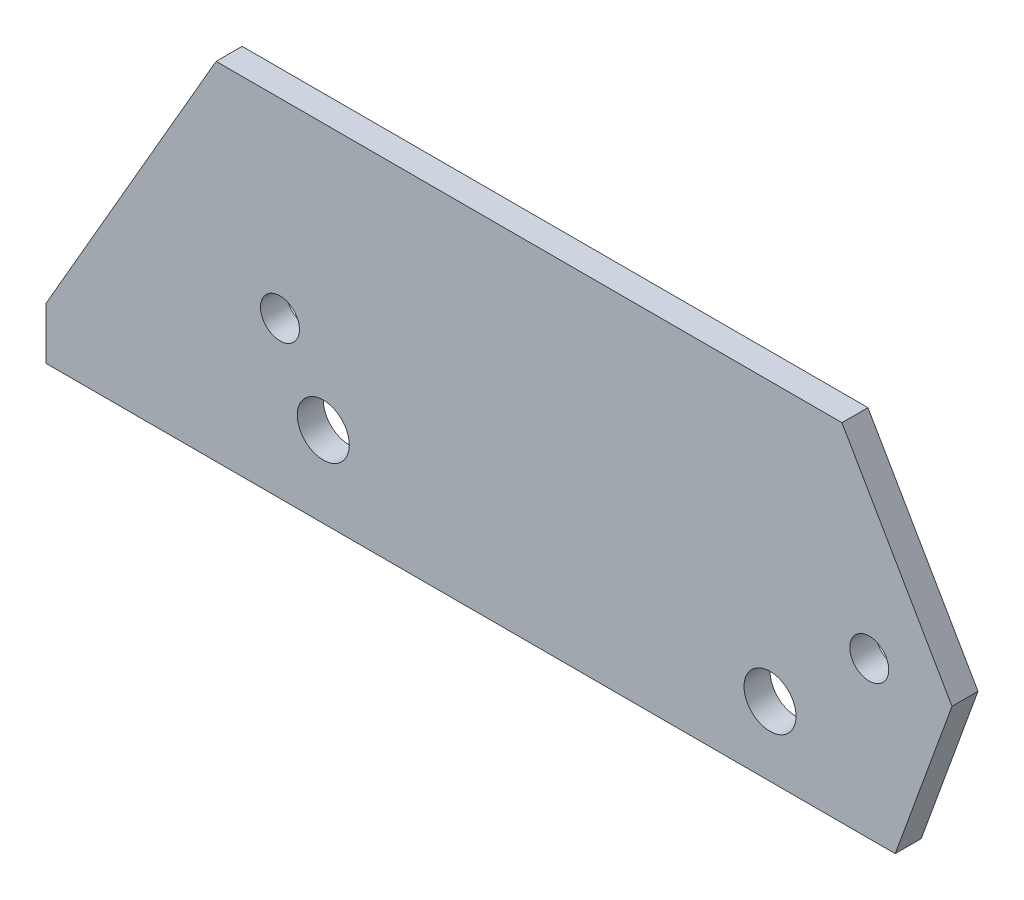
from build123d import *

# Parameters (mm, degrees)
SKETCH1_R      = 2.25
SKETCH1_R_2    = 3
EXTRUDE1_DEPTH = 3


with BuildPart() as part:
    # Sketch1 → Extrude1 (new body)
    with BuildSketch(Plane.XY):
        Polygon((0, 0), (0, 6), (19.629909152, 40), (91.849758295, 40), (104.551464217, 18), (98, 0), align=None)
        with Locations((27, 18)):
            Circle(SKETCH1_R, mode=Mode.SUBTRACT)
        with Locations((32, 9.339745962)):
            Circle(SKETCH1_R_2, mode=Mode.SUBTRACT)
        with Locations((95, 18)):
            Circle(SKETCH1_R, mode=Mode.SUBTRACT)
        with Locations((83.551464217, 8)):
            Circle(SKETCH1_R_2, mode=Mode.SUBTRACT)
    extrude(amount=EXTRUDE1_DEPTH)


solid = part.part
